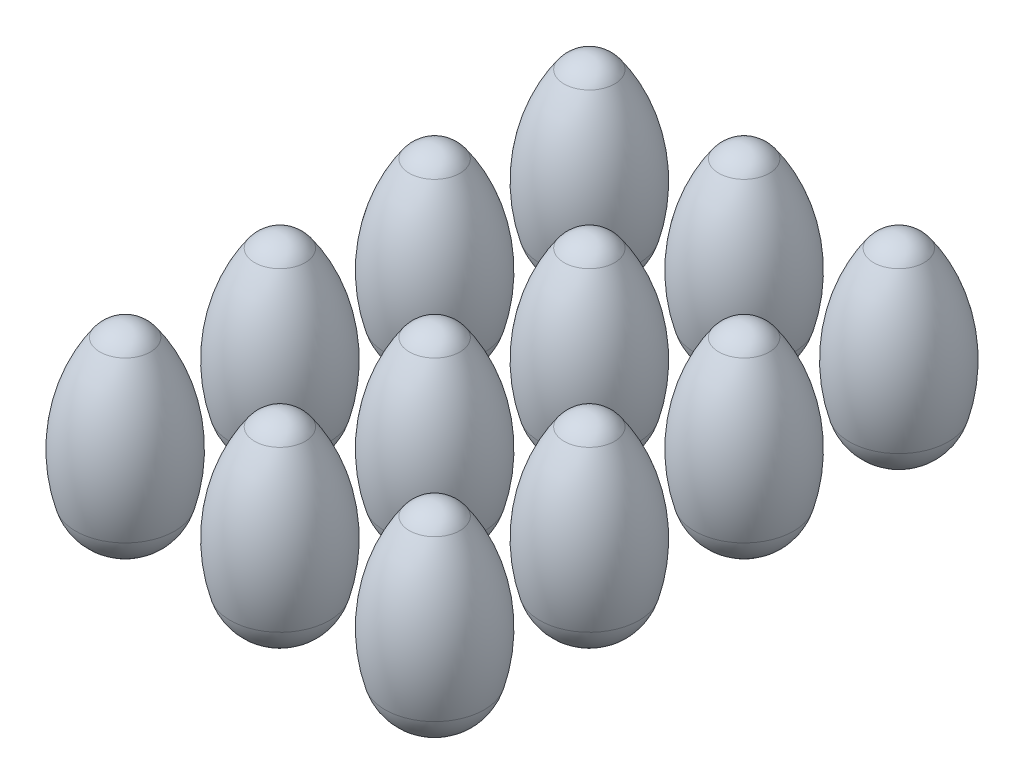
from build123d import *

# Parameters (mm, degrees)
LPATTERN2_COUNT   = 4
LPATTERN2_PITCH   = 60
LPATTERN2_2_COUNT = 3
LPATTERN2_2_PITCH = 60


with BuildPart() as part:
    # Sketch1 → Revolve1 (revolve)
    with BuildSketch(Plane.XY):
        with BuildLine():
            Line((0, 75), (0, 0))
            ThreePointArc((0, 0), (12.039985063, 4.03006701), (19.227775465, 14.496124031))
            ThreePointArc((19.227775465, 14.496124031), (20.816530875, 43.286861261), (9.79528184, 69.931987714))
            ThreePointArc((9.79528184, 69.931987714), (5.514351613, 73.657951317), (0, 75))
        make_face()
    revolve(axis=Axis((0, 0, 0), (0, 1, 0)))


with BuildPart() as lpattern2_1:
    # LPattern2: pattern copy
    add(part.part.moved(Location(Vector(0, 0, -1) * (1 * LPATTERN2_PITCH))))


with BuildPart() as lpattern2_2:
    # LPattern2: pattern copy
    add(part.part.moved(Location(Vector(0, 0, -1) * (2 * LPATTERN2_PITCH))))


with BuildPart() as lpattern2_3:
    # LPattern2: pattern copy
    add(part.part.moved(Location(Vector(0, 0, -1) * (3 * LPATTERN2_PITCH))))


with BuildPart() as lpattern2_2_1:
    # LPattern2 2: pattern copy
    add(part.part.moved(Location(Vector(-1, 0, 0) * (1 * LPATTERN2_2_PITCH))))


with BuildPart() as lpattern2_2_2:
    # LPattern2 2: pattern copy
    add(part.part.moved(Location(Vector(-1, 0, 0) * (2 * LPATTERN2_2_PITCH))))


with BuildPart() as lpattern2_2_3:
    # LPattern2 2: pattern copy
    add(lpattern2_1.part.moved(Location(Vector(-1, 0, 0) * (1 * LPATTERN2_2_PITCH))))


with BuildPart() as lpattern2_2_4:
    # LPattern2 2: pattern copy
    add(lpattern2_1.part.moved(Location(Vector(-1, 0, 0) * (2 * LPATTERN2_2_PITCH))))


with BuildPart() as lpattern2_2_5:
    # LPattern2 2: pattern copy
    add(lpattern2_2.part.moved(Location(Vector(-1, 0, 0) * (1 * LPATTERN2_2_PITCH))))


with BuildPart() as lpattern2_2_6:
    # LPattern2 2: pattern copy
    add(lpattern2_2.part.moved(Location(Vector(-1, 0, 0) * (2 * LPATTERN2_2_PITCH))))


with BuildPart() as lpattern2_2_7:
    # LPattern2 2: pattern copy
    add(lpattern2_3.part.moved(Location(Vector(-1, 0, 0) * (1 * LPATTERN2_2_PITCH))))


with BuildPart() as lpattern2_2_8:
    # LPattern2 2: pattern copy
    add(lpattern2_3.part.moved(Location(Vector(-1, 0, 0) * (2 * LPATTERN2_2_PITCH))))


solid = Compound([part.part, lpattern2_1.part, lpattern2_2.part, lpattern2_3.part, lpattern2_2_1.part, lpattern2_2_2.part, lpattern2_2_3.part, lpattern2_2_4.part, lpattern2_2_5.part, lpattern2_2_6.part, lpattern2_2_7.part, lpattern2_2_8.part])
